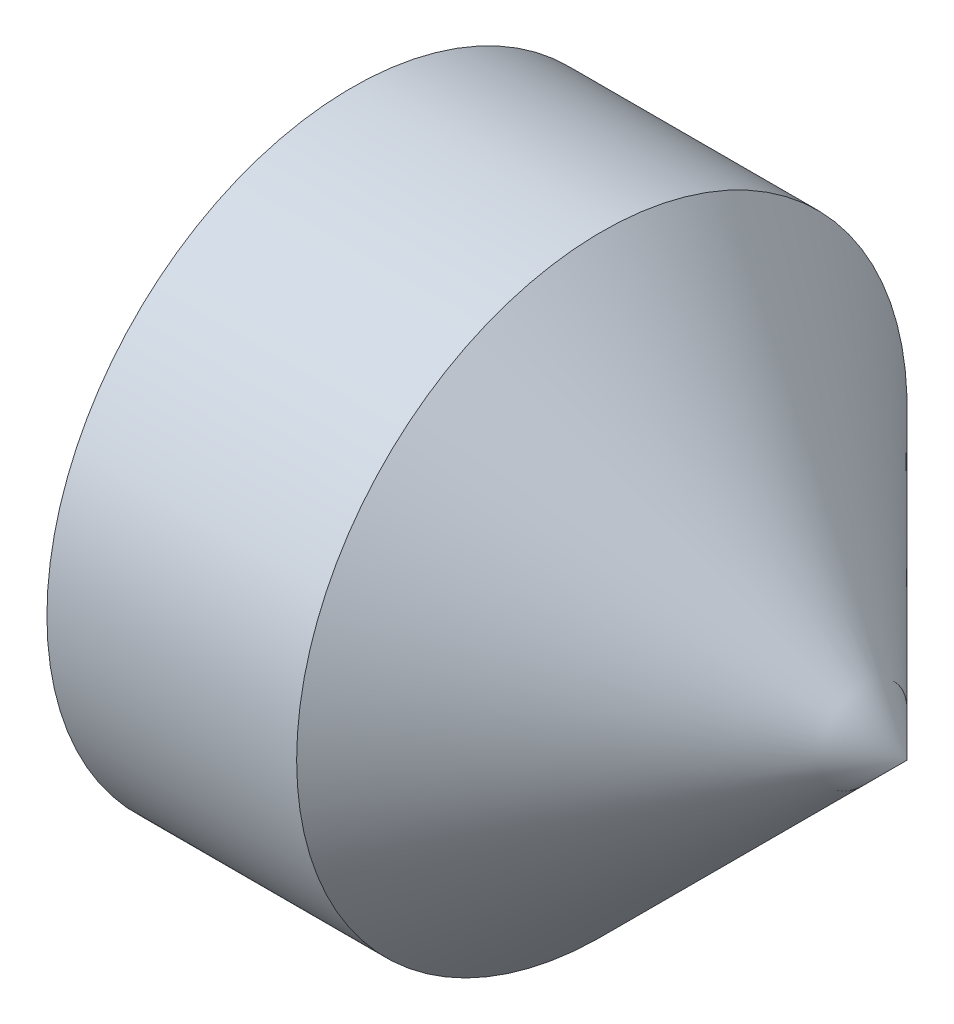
ISO-10303-21;
HEADER;
FILE_DESCRIPTION(('STEP AP214'),'2;1');
FILE_NAME('part.step','',(''),(''),'','','');
FILE_SCHEMA(('AUTOMOTIVE_DESIGN { 1 0 10303 214 1 1 1 1 }'));
ENDSEC;
DATA;
#1=APPLICATION_CONTEXT('core data for automotive mechanical design processes');
#2=APPLICATION_PROTOCOL_DEFINITION('international standard','automotive_design',2000,#1);
#3=PRODUCT_CONTEXT('',#1,'mechanical');
#4=PRODUCT('Part','Part','',(#3));
#5=PRODUCT_RELATED_PRODUCT_CATEGORY('part','',(#4));
#6=PRODUCT_DEFINITION_FORMATION('','',#4);
#7=PRODUCT_DEFINITION_CONTEXT('part definition',#1,'design');
#8=PRODUCT_DEFINITION('design','',#6,#7);
#9=PRODUCT_DEFINITION_SHAPE('','',#8);
#10=(LENGTH_UNIT() NAMED_UNIT(*) SI_UNIT(.MILLI.,.METRE.));
#11=(NAMED_UNIT(*) PLANE_ANGLE_UNIT() SI_UNIT($,.RADIAN.));
#12=(NAMED_UNIT(*) SI_UNIT($,.STERADIAN.) SOLID_ANGLE_UNIT());
#13=UNCERTAINTY_MEASURE_WITH_UNIT(LENGTH_MEASURE(1.E-05),#10,'distance_accuracy_value','');
#14=(GEOMETRIC_REPRESENTATION_CONTEXT(3) GLOBAL_UNCERTAINTY_ASSIGNED_CONTEXT((#13)) GLOBAL_UNIT_ASSIGNED_CONTEXT((#10,
#11,#12)) REPRESENTATION_CONTEXT('',''));
#15=CARTESIAN_POINT('',(0.,0.,0.));
#16=DIRECTION('',(0.,0.,1.));
#17=DIRECTION('',(1.,0.,0.));
#18=AXIS2_PLACEMENT_3D('',#15,#16,#17);
#19=CARTESIAN_POINT('',(0.,0.,0.));
#20=DIRECTION('',(-1.,0.,0.));
#21=DIRECTION('',(0.,0.,1.));
#22=AXIS2_PLACEMENT_3D('',#19,#20,#21);
#23=PLANE('',#22);
#24=CARTESIAN_POINT('',(0.,0.,0.));
#25=DIRECTION('',(-1.,0.,0.));
#26=DIRECTION('',(0.,0.,1.));
#27=AXIS2_PLACEMENT_3D('',#24,#25,#26);
#28=CIRCLE('',#27,2.055);
#29=CARTESIAN_POINT('',(0.,0.,2.055));
#30=VERTEX_POINT('',#29);
#31=EDGE_CURVE('E11',#30,#30,#28,.T.);
#32=ORIENTED_EDGE('',*,*,#31,.T.);
#33=EDGE_LOOP('',(#32));
#34=FACE_BOUND('',#33,.T.);
#35=DIRECTION('',(0.,0.,-1.));
#36=VECTOR('',#35,1.);
#37=CARTESIAN_POINT('',(0.,1.25,0.721687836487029));
#38=LINE('',#37,#36);
#39=CARTESIAN_POINT('',(0.,1.25,0.721687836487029));
#40=VERTEX_POINT('',#39);
#41=CARTESIAN_POINT('',(0.,1.25,-0.721687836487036));
#42=VERTEX_POINT('',#41);
#43=EDGE_CURVE('E94',#40,#42,#38,.T.);
#44=ORIENTED_EDGE('',*,*,#43,.F.);
#45=DIRECTION('',(0.,-0.866025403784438,0.500000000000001));
#46=VECTOR('',#45,1.);
#47=CARTESIAN_POINT('',(0.,1.25,0.721687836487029));
#48=LINE('',#47,#46);
#49=CARTESIAN_POINT('',(0.,0.,1.44337567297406));
#50=VERTEX_POINT('',#49);
#51=EDGE_CURVE('E47',#40,#50,#48,.T.);
#52=ORIENTED_EDGE('',*,*,#51,.T.);
#53=DIRECTION('',(0.,0.866025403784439,0.5));
#54=VECTOR('',#53,1.);
#55=CARTESIAN_POINT('',(0.,-1.25,0.721687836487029));
#56=LINE('',#55,#54);
#57=CARTESIAN_POINT('',(0.,-1.25,0.721687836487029));
#58=VERTEX_POINT('',#57);
#59=EDGE_CURVE('E100',#58,#50,#56,.T.);
#60=ORIENTED_EDGE('',*,*,#59,.F.);
#61=DIRECTION('',(0.,0.,-1.));
#62=VECTOR('',#61,1.);
#63=CARTESIAN_POINT('',(0.,-1.25,0.721687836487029));
#64=LINE('',#63,#62);
#65=CARTESIAN_POINT('',(0.,-1.25,-0.721687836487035));
#66=VERTEX_POINT('',#65);
#67=EDGE_CURVE('E120',#58,#66,#64,.T.);
#68=ORIENTED_EDGE('',*,*,#67,.T.);
#69=DIRECTION('',(0.,0.866025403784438,-0.500000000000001));
#70=VECTOR('',#69,1.);
#71=CARTESIAN_POINT('',(0.,-1.25,-0.721687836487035));
#72=LINE('',#71,#70);
#73=CARTESIAN_POINT('',(0.,0.,-1.44337567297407));
#74=VERTEX_POINT('',#73);
#75=EDGE_CURVE('E123',#66,#74,#72,.T.);
#76=ORIENTED_EDGE('',*,*,#75,.T.);
#77=DIRECTION('',(0.,-0.866025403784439,-0.5));
#78=VECTOR('',#77,1.);
#79=CARTESIAN_POINT('',(0.,1.25,-0.721687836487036));
#80=LINE('',#79,#78);
#81=EDGE_CURVE('E126',#42,#74,#80,.T.);
#82=ORIENTED_EDGE('',*,*,#81,.F.);
#83=EDGE_LOOP('',(#44,#52,#60,#68,#76,#82));
#84=FACE_BOUND('',#83,.T.);
#85=ADVANCED_FACE('F33',(#34,#84),#23,.T.);
#86=CARTESIAN_POINT('',(0.,0.,0.));
#87=DIRECTION('',(1.,0.,0.));
#88=DIRECTION('',(0.,0.,-1.));
#89=AXIS2_PLACEMENT_3D('',#86,#87,#88);
#90=CONICAL_SURFACE('',#89,2.055,1.04719755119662);
#91=CARTESIAN_POINT('',(0.545596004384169,0.,0.));
#92=DIRECTION('',(-1.,0.,0.));
#93=DIRECTION('',(0.,0.,1.));
#94=AXIS2_PLACEMENT_3D('',#91,#92,#93);
#95=CIRCLE('',#94,3.);
#96=CARTESIAN_POINT('',(0.545596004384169,0.,3.));
#97=VERTEX_POINT('',#96);
#98=EDGE_CURVE('E40',#97,#97,#95,.T.);
#99=ORIENTED_EDGE('',*,*,#98,.T.);
#100=EDGE_LOOP('',(#99));
#101=FACE_BOUND('',#100,.T.);
#102=ORIENTED_EDGE('',*,*,#31,.F.);
#103=EDGE_LOOP('',(#102));
#104=FACE_BOUND('',#103,.T.);
#105=ADVANCED_FACE('F143',(#101,#104),#90,.T.);
#106=CARTESIAN_POINT('',(-12.7,0.,0.));
#107=DIRECTION('',(-1.,0.,0.));
#108=DIRECTION('',(0.,0.,1.));
#109=AXIS2_PLACEMENT_3D('',#106,#107,#108);
#110=CYLINDRICAL_SURFACE('',#109,3.);
#111=CARTESIAN_POINT('',(3.00000000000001,0.,0.));
#112=DIRECTION('',(-1.,0.,0.));
#113=DIRECTION('',(0.,0.,1.));
#114=AXIS2_PLACEMENT_3D('',#111,#112,#113);
#115=CIRCLE('',#114,3.);
#116=CARTESIAN_POINT('',(3.00000000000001,0.,3.));
#117=VERTEX_POINT('',#116);
#118=EDGE_CURVE('E101',#117,#117,#115,.T.);
#119=ORIENTED_EDGE('',*,*,#118,.T.);
#120=EDGE_LOOP('',(#119));
#121=FACE_BOUND('',#120,.T.);
#122=ORIENTED_EDGE('',*,*,#98,.F.);
#123=EDGE_LOOP('',(#122));
#124=FACE_BOUND('',#123,.T.);
#125=ADVANCED_FACE('F146',(#121,#124),#110,.T.);
#126=CARTESIAN_POINT('',(3.00000000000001,0.,0.));
#127=DIRECTION('',(-1.,0.,0.));
#128=DIRECTION('',(0.,0.,1.));
#129=AXIS2_PLACEMENT_3D('',#126,#127,#128);
#130=CONICAL_SURFACE('',#129,3.,0.78539816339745);
#131=CARTESIAN_POINT('',(6.,0.,0.));
#132=VERTEX_POINT('',#131);
#133=VERTEX_LOOP('',#132);
#134=FACE_BOUND('',#133,.T.);
#135=ORIENTED_EDGE('',*,*,#118,.F.);
#136=EDGE_LOOP('',(#135));
#137=FACE_BOUND('',#136,.T.);
#138=ADVANCED_FACE('F148',(#134,#137),#130,.T.);
#139=CARTESIAN_POINT('',(3.,1.25,0.721687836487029));
#140=DIRECTION('',(0.,-0.500000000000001,-0.866025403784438));
#141=DIRECTION('',(0.,0.866025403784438,-0.500000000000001));
#142=AXIS2_PLACEMENT_3D('',#139,#140,#141);
#143=PLANE('',#142);
#144=ORIENTED_EDGE('',*,*,#51,.F.);
#145=DIRECTION('',(-1.,0.,0.));
#146=VECTOR('',#145,1.);
#147=CARTESIAN_POINT('',(3.,1.25,0.721687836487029));
#148=LINE('',#147,#146);
#149=CARTESIAN_POINT('',(3.,1.25,0.721687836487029));
#150=VERTEX_POINT('',#149);
#151=EDGE_CURVE('E88',#150,#40,#148,.T.);
#152=ORIENTED_EDGE('',*,*,#151,.F.);
#153=DIRECTION('',(0.,-0.866025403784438,0.500000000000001));
#154=VECTOR('',#153,1.);
#155=CARTESIAN_POINT('',(3.,1.25,0.721687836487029));
#156=LINE('',#155,#154);
#157=CARTESIAN_POINT('',(3.,0.,1.44337567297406));
#158=VERTEX_POINT('',#157);
#159=EDGE_CURVE('E83',#150,#158,#156,.T.);
#160=ORIENTED_EDGE('',*,*,#159,.T.);
#161=DIRECTION('',(-1.,0.,0.));
#162=VECTOR('',#161,1.);
#163=CARTESIAN_POINT('',(3.,0.,1.44337567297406));
#164=LINE('',#163,#162);
#165=EDGE_CURVE('E86',#158,#50,#164,.T.);
#166=ORIENTED_EDGE('',*,*,#165,.T.);
#167=EDGE_LOOP('',(#144,#152,#160,#166));
#168=FACE_BOUND('',#167,.T.);
#169=ADVANCED_FACE('F85',(#168),#143,.T.);
#170=CARTESIAN_POINT('',(3.,-1.25,0.721687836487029));
#171=DIRECTION('',(0.,-0.5,0.866025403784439));
#172=DIRECTION('',(0.,-0.866025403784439,-0.5));
#173=AXIS2_PLACEMENT_3D('',#170,#171,#172);
#174=PLANE('',#173);
#175=ORIENTED_EDGE('',*,*,#59,.T.);
#176=ORIENTED_EDGE('',*,*,#165,.F.);
#177=DIRECTION('',(0.,0.866025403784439,0.5));
#178=VECTOR('',#177,1.);
#179=CARTESIAN_POINT('',(3.,-1.25,0.721687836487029));
#180=LINE('',#179,#178);
#181=CARTESIAN_POINT('',(3.,-1.25,0.721687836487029));
#182=VERTEX_POINT('',#181);
#183=EDGE_CURVE('E93',#182,#158,#180,.T.);
#184=ORIENTED_EDGE('',*,*,#183,.F.);
#185=DIRECTION('',(-1.,0.,0.));
#186=VECTOR('',#185,1.);
#187=CARTESIAN_POINT('',(3.,-1.25,0.721687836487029));
#188=LINE('',#187,#186);
#189=EDGE_CURVE('E102',#182,#58,#188,.T.);
#190=ORIENTED_EDGE('',*,*,#189,.T.);
#191=EDGE_LOOP('',(#175,#176,#184,#190));
#192=FACE_BOUND('',#191,.T.);
#193=ADVANCED_FACE('F98',(#192),#174,.F.);
#194=CARTESIAN_POINT('',(3.,-1.25,0.721687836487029));
#195=DIRECTION('',(0.,1.,0.));
#196=DIRECTION('',(0.,0.,1.));
#197=AXIS2_PLACEMENT_3D('',#194,#195,#196);
#198=PLANE('',#197);
#199=ORIENTED_EDGE('',*,*,#67,.F.);
#200=ORIENTED_EDGE('',*,*,#189,.F.);
#201=DIRECTION('',(0.,0.,-1.));
#202=VECTOR('',#201,1.);
#203=CARTESIAN_POINT('',(3.,-1.25,0.721687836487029));
#204=LINE('',#203,#202);
#205=CARTESIAN_POINT('',(3.,-1.25,-0.721687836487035));
#206=VERTEX_POINT('',#205);
#207=EDGE_CURVE('E107',#182,#206,#204,.T.);
#208=ORIENTED_EDGE('',*,*,#207,.T.);
#209=DIRECTION('',(-1.,0.,0.));
#210=VECTOR('',#209,1.);
#211=CARTESIAN_POINT('',(3.,-1.25,-0.721687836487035));
#212=LINE('',#211,#210);
#213=EDGE_CURVE('E136',#206,#66,#212,.T.);
#214=ORIENTED_EDGE('',*,*,#213,.T.);
#215=EDGE_LOOP('',(#199,#200,#208,#214));
#216=FACE_BOUND('',#215,.T.);
#217=ADVANCED_FACE('F176',(#216),#198,.T.);
#218=CARTESIAN_POINT('',(3.,-1.25,-0.721687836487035));
#219=DIRECTION('',(0.,0.500000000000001,0.866025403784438));
#220=DIRECTION('',(0.,-0.866025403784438,0.500000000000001));
#221=AXIS2_PLACEMENT_3D('',#218,#219,#220);
#222=PLANE('',#221);
#223=ORIENTED_EDGE('',*,*,#75,.F.);
#224=ORIENTED_EDGE('',*,*,#213,.F.);
#225=DIRECTION('',(0.,0.866025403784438,-0.500000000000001));
#226=VECTOR('',#225,1.);
#227=CARTESIAN_POINT('',(3.,-1.25,-0.721687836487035));
#228=LINE('',#227,#226);
#229=CARTESIAN_POINT('',(3.,0.,-1.44337567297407));
#230=VERTEX_POINT('',#229);
#231=EDGE_CURVE('E109',#206,#230,#228,.T.);
#232=ORIENTED_EDGE('',*,*,#231,.T.);
#233=DIRECTION('',(-1.,0.,0.));
#234=VECTOR('',#233,1.);
#235=CARTESIAN_POINT('',(3.,0.,-1.44337567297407));
#236=LINE('',#235,#234);
#237=EDGE_CURVE('E134',#230,#74,#236,.T.);
#238=ORIENTED_EDGE('',*,*,#237,.T.);
#239=EDGE_LOOP('',(#223,#224,#232,#238));
#240=FACE_BOUND('',#239,.T.);
#241=ADVANCED_FACE('F172',(#240),#222,.T.);
#242=CARTESIAN_POINT('',(3.,1.25,-0.721687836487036));
#243=DIRECTION('',(0.,0.5,-0.866025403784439));
#244=DIRECTION('',(0.,0.866025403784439,0.5));
#245=AXIS2_PLACEMENT_3D('',#242,#243,#244);
#246=PLANE('',#245);
#247=ORIENTED_EDGE('',*,*,#81,.T.);
#248=ORIENTED_EDGE('',*,*,#237,.F.);
#249=DIRECTION('',(0.,-0.866025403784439,-0.5));
#250=VECTOR('',#249,1.);
#251=CARTESIAN_POINT('',(3.,1.25,-0.721687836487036));
#252=LINE('',#251,#250);
#253=CARTESIAN_POINT('',(3.,1.25,-0.721687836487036));
#254=VERTEX_POINT('',#253);
#255=EDGE_CURVE('E113',#254,#230,#252,.T.);
#256=ORIENTED_EDGE('',*,*,#255,.F.);
#257=DIRECTION('',(-1.,0.,0.));
#258=VECTOR('',#257,1.);
#259=CARTESIAN_POINT('',(3.,1.25,-0.721687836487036));
#260=LINE('',#259,#258);
#261=EDGE_CURVE('E132',#254,#42,#260,.T.);
#262=ORIENTED_EDGE('',*,*,#261,.T.);
#263=EDGE_LOOP('',(#247,#248,#256,#262));
#264=FACE_BOUND('',#263,.T.);
#265=ADVANCED_FACE('F169',(#264),#246,.F.);
#266=CARTESIAN_POINT('',(3.,1.25,0.721687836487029));
#267=DIRECTION('',(0.,1.,0.));
#268=DIRECTION('',(0.,0.,1.));
#269=AXIS2_PLACEMENT_3D('',#266,#267,#268);
#270=PLANE('',#269);
#271=ORIENTED_EDGE('',*,*,#43,.T.);
#272=ORIENTED_EDGE('',*,*,#261,.F.);
#273=DIRECTION('',(0.,0.,-1.));
#274=VECTOR('',#273,1.);
#275=CARTESIAN_POINT('',(3.,1.25,0.721687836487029));
#276=LINE('',#275,#274);
#277=EDGE_CURVE('E116',#150,#254,#276,.T.);
#278=ORIENTED_EDGE('',*,*,#277,.F.);
#279=ORIENTED_EDGE('',*,*,#151,.T.);
#280=EDGE_LOOP('',(#271,#272,#278,#279));
#281=FACE_BOUND('',#280,.T.);
#282=ADVANCED_FACE('F165',(#281),#270,.F.);
#283=CARTESIAN_POINT('',(3.,0.,1.44337567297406));
#284=DIRECTION('',(-1.,0.,0.));
#285=DIRECTION('',(0.,0.,1.));
#286=AXIS2_PLACEMENT_3D('',#283,#284,#285);
#287=PLANE('',#286);
#288=ORIENTED_EDGE('',*,*,#159,.F.);
#289=ORIENTED_EDGE('',*,*,#277,.T.);
#290=ORIENTED_EDGE('',*,*,#255,.T.);
#291=ORIENTED_EDGE('',*,*,#231,.F.);
#292=ORIENTED_EDGE('',*,*,#207,.F.);
#293=ORIENTED_EDGE('',*,*,#183,.T.);
#294=EDGE_LOOP('',(#288,#289,#290,#291,#292,#293));
#295=FACE_BOUND('',#294,.T.);
#296=ADVANCED_FACE('F105',(#295),#287,.T.);
#297=CLOSED_SHELL('',(#85,#105,#125,#138,#169,#193,#217,#241,#265,#282,#296));
#298=MANIFOLD_SOLID_BREP('B2',#297);
#299=ADVANCED_BREP_SHAPE_REPRESENTATION('',(#18,#298),#14);
#300=SHAPE_DEFINITION_REPRESENTATION(#9,#299);
ENDSEC;
END-ISO-10303-21;
